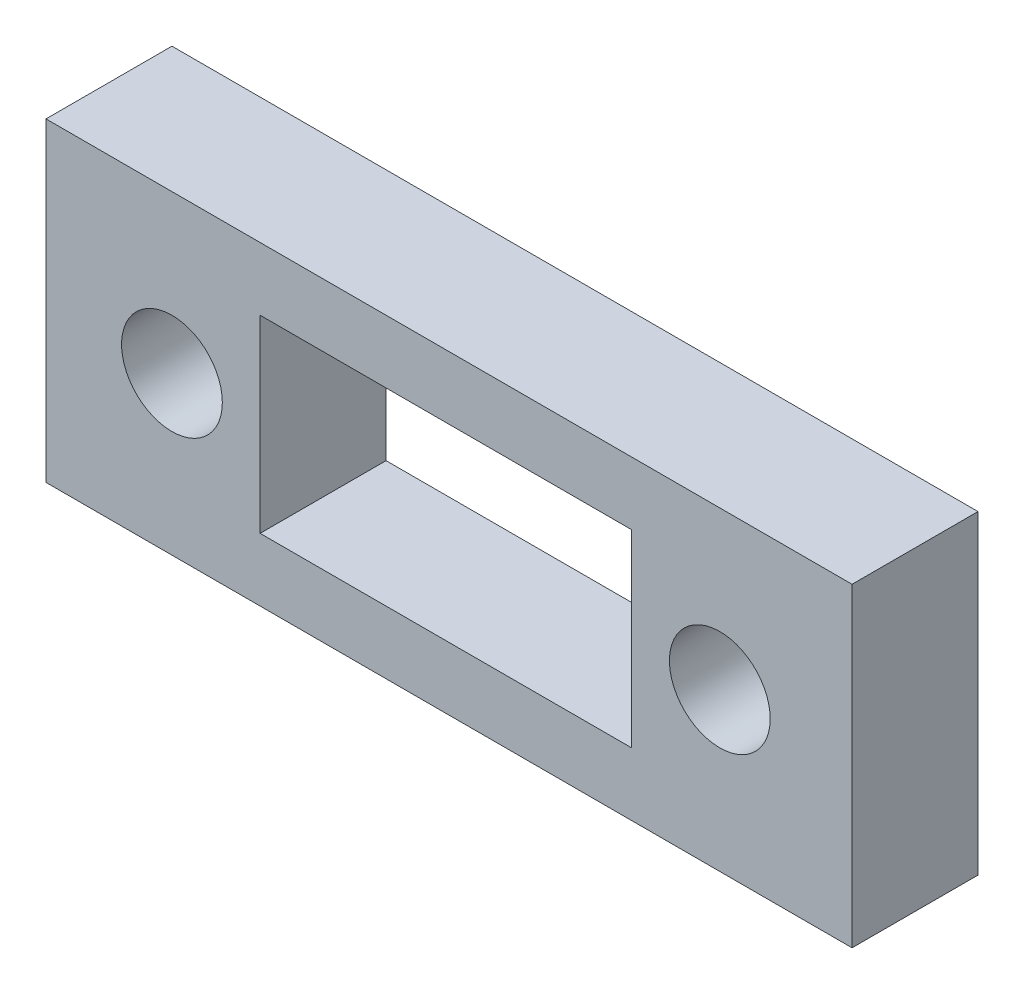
ISO-10303-21;
HEADER;
FILE_DESCRIPTION(('STEP AP214'),'2;1');
FILE_NAME('part.step','',(''),(''),'','','');
FILE_SCHEMA(('AUTOMOTIVE_DESIGN { 1 0 10303 214 1 1 1 1 }'));
ENDSEC;
DATA;
#1=APPLICATION_CONTEXT('core data for automotive mechanical design processes');
#2=APPLICATION_PROTOCOL_DEFINITION('international standard','automotive_design',2000,#1);
#3=PRODUCT_CONTEXT('',#1,'mechanical');
#4=PRODUCT('Part','Part','',(#3));
#5=PRODUCT_RELATED_PRODUCT_CATEGORY('part','',(#4));
#6=PRODUCT_DEFINITION_FORMATION('','',#4);
#7=PRODUCT_DEFINITION_CONTEXT('part definition',#1,'design');
#8=PRODUCT_DEFINITION('design','',#6,#7);
#9=PRODUCT_DEFINITION_SHAPE('','',#8);
#10=(LENGTH_UNIT() NAMED_UNIT(*) SI_UNIT(.MILLI.,.METRE.));
#11=(NAMED_UNIT(*) PLANE_ANGLE_UNIT() SI_UNIT($,.RADIAN.));
#12=(NAMED_UNIT(*) SI_UNIT($,.STERADIAN.) SOLID_ANGLE_UNIT());
#13=UNCERTAINTY_MEASURE_WITH_UNIT(LENGTH_MEASURE(1.E-05),#10,'distance_accuracy_value','');
#14=(GEOMETRIC_REPRESENTATION_CONTEXT(3) GLOBAL_UNCERTAINTY_ASSIGNED_CONTEXT((#13)) GLOBAL_UNIT_ASSIGNED_CONTEXT((#10,
#11,#12)) REPRESENTATION_CONTEXT('',''));
#15=CARTESIAN_POINT('',(0.,0.,0.));
#16=DIRECTION('',(0.,0.,1.));
#17=DIRECTION('',(1.,0.,0.));
#18=AXIS2_PLACEMENT_3D('',#15,#16,#17);
#19=CARTESIAN_POINT('',(-7.04952538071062,9.47419627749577,10.));
#20=DIRECTION('',(1.,0.,0.));
#21=DIRECTION('',(0.,0.,-1.));
#22=AXIS2_PLACEMENT_3D('',#19,#20,#21);
#23=PLANE('',#22);
#24=DIRECTION('',(0.,-1.,0.));
#25=VECTOR('',#24,1.);
#26=CARTESIAN_POINT('',(-7.04952538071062,9.47419627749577,0.));
#27=LINE('',#26,#25);
#28=CARTESIAN_POINT('',(-7.04952538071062,9.47419627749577,0.));
#29=VERTEX_POINT('',#28);
#30=CARTESIAN_POINT('',(-7.04952538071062,-15.5258037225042,0.));
#31=VERTEX_POINT('',#30);
#32=EDGE_CURVE('E143',#29,#31,#27,.T.);
#33=ORIENTED_EDGE('',*,*,#32,.T.);
#34=DIRECTION('',(0.,0.,-1.));
#35=VECTOR('',#34,1.);
#36=CARTESIAN_POINT('',(-7.04952538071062,-15.5258037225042,10.));
#37=LINE('',#36,#35);
#38=CARTESIAN_POINT('',(-7.04952538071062,-15.5258037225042,10.));
#39=VERTEX_POINT('',#38);
#40=EDGE_CURVE('E11',#39,#31,#37,.T.);
#41=ORIENTED_EDGE('',*,*,#40,.F.);
#42=DIRECTION('',(0.,-1.,0.));
#43=VECTOR('',#42,1.);
#44=CARTESIAN_POINT('',(-7.04952538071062,9.47419627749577,10.));
#45=LINE('',#44,#43);
#46=CARTESIAN_POINT('',(-7.04952538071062,9.47419627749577,10.));
#47=VERTEX_POINT('',#46);
#48=EDGE_CURVE('E146',#47,#39,#45,.T.);
#49=ORIENTED_EDGE('',*,*,#48,.F.);
#50=DIRECTION('',(0.,0.,-1.));
#51=VECTOR('',#50,1.);
#52=CARTESIAN_POINT('',(-7.04952538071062,9.47419627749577,10.));
#53=LINE('',#52,#51);
#54=EDGE_CURVE('E156',#47,#29,#53,.T.);
#55=ORIENTED_EDGE('',*,*,#54,.T.);
#56=EDGE_LOOP('',(#33,#41,#49,#55));
#57=FACE_BOUND('',#56,.T.);
#58=ADVANCED_FACE('F33',(#57),#23,.F.);
#59=CARTESIAN_POINT('',(-7.04952538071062,-15.5258037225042,10.));
#60=DIRECTION('',(0.,1.,0.));
#61=DIRECTION('',(0.,0.,1.));
#62=AXIS2_PLACEMENT_3D('',#59,#60,#61);
#63=PLANE('',#62);
#64=DIRECTION('',(1.,0.,0.));
#65=VECTOR('',#64,1.);
#66=CARTESIAN_POINT('',(-7.04952538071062,-15.5258037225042,0.));
#67=LINE('',#66,#65);
#68=CARTESIAN_POINT('',(56.9504746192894,-15.5258037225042,0.));
#69=VERTEX_POINT('',#68);
#70=EDGE_CURVE('E159',#31,#69,#67,.T.);
#71=ORIENTED_EDGE('',*,*,#70,.T.);
#72=DIRECTION('',(0.,0.,-1.));
#73=VECTOR('',#72,1.);
#74=CARTESIAN_POINT('',(56.9504746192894,-15.5258037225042,10.));
#75=LINE('',#74,#73);
#76=CARTESIAN_POINT('',(56.9504746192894,-15.5258037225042,10.));
#77=VERTEX_POINT('',#76);
#78=EDGE_CURVE('E40',#77,#69,#75,.T.);
#79=ORIENTED_EDGE('',*,*,#78,.F.);
#80=DIRECTION('',(1.,0.,0.));
#81=VECTOR('',#80,1.);
#82=CARTESIAN_POINT('',(-7.04952538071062,-15.5258037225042,10.));
#83=LINE('',#82,#81);
#84=EDGE_CURVE('E149',#39,#77,#83,.T.);
#85=ORIENTED_EDGE('',*,*,#84,.F.);
#86=ORIENTED_EDGE('',*,*,#40,.T.);
#87=EDGE_LOOP('',(#71,#79,#85,#86));
#88=FACE_BOUND('',#87,.T.);
#89=ADVANCED_FACE('F188',(#88),#63,.F.);
#90=CARTESIAN_POINT('',(56.9504746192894,9.47419627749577,10.));
#91=DIRECTION('',(-1.,0.,0.));
#92=DIRECTION('',(0.,-1.,0.));
#93=AXIS2_PLACEMENT_3D('',#90,#91,#92);
#94=PLANE('',#93);
#95=DIRECTION('',(0.,1.,0.));
#96=VECTOR('',#95,1.);
#97=CARTESIAN_POINT('',(56.9504746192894,9.47419627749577,0.));
#98=LINE('',#97,#96);
#99=CARTESIAN_POINT('',(56.9504746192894,9.47419627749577,0.));
#100=VERTEX_POINT('',#99);
#101=EDGE_CURVE('E161',#69,#100,#98,.T.);
#102=ORIENTED_EDGE('',*,*,#101,.T.);
#103=DIRECTION('',(0.,0.,-1.));
#104=VECTOR('',#103,1.);
#105=CARTESIAN_POINT('',(56.9504746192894,9.47419627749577,10.));
#106=LINE('',#105,#104);
#107=CARTESIAN_POINT('',(56.9504746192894,9.47419627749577,10.));
#108=VERTEX_POINT('',#107);
#109=EDGE_CURVE('E166',#108,#100,#106,.T.);
#110=ORIENTED_EDGE('',*,*,#109,.F.);
#111=DIRECTION('',(0.,1.,0.));
#112=VECTOR('',#111,1.);
#113=CARTESIAN_POINT('',(56.9504746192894,9.47419627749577,10.));
#114=LINE('',#113,#112);
#115=EDGE_CURVE('E152',#77,#108,#114,.T.);
#116=ORIENTED_EDGE('',*,*,#115,.F.);
#117=ORIENTED_EDGE('',*,*,#78,.T.);
#118=EDGE_LOOP('',(#102,#110,#116,#117));
#119=FACE_BOUND('',#118,.T.);
#120=ADVANCED_FACE('F173',(#119),#94,.F.);
#121=CARTESIAN_POINT('',(-7.04952538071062,9.47419627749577,10.));
#122=DIRECTION('',(0.,-1.,0.));
#123=DIRECTION('',(0.,0.,-1.));
#124=AXIS2_PLACEMENT_3D('',#121,#122,#123);
#125=PLANE('',#124);
#126=DIRECTION('',(-1.,0.,0.));
#127=VECTOR('',#126,1.);
#128=CARTESIAN_POINT('',(-7.04952538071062,9.47419627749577,0.));
#129=LINE('',#128,#127);
#130=EDGE_CURVE('E150',#100,#29,#129,.T.);
#131=ORIENTED_EDGE('',*,*,#130,.T.);
#132=ORIENTED_EDGE('',*,*,#54,.F.);
#133=DIRECTION('',(-1.,0.,0.));
#134=VECTOR('',#133,1.);
#135=CARTESIAN_POINT('',(-7.04952538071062,9.47419627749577,10.));
#136=LINE('',#135,#134);
#137=EDGE_CURVE('E154',#108,#47,#136,.T.);
#138=ORIENTED_EDGE('',*,*,#137,.F.);
#139=ORIENTED_EDGE('',*,*,#109,.T.);
#140=EDGE_LOOP('',(#131,#132,#138,#139));
#141=FACE_BOUND('',#140,.T.);
#142=ADVANCED_FACE('F181',(#141),#125,.F.);
#143=CARTESIAN_POINT('',(0.,0.,10.));
#144=DIRECTION('',(0.,0.,1.));
#145=DIRECTION('',(1.,0.,0.));
#146=AXIS2_PLACEMENT_3D('',#143,#144,#145);
#147=PLANE('',#146);
#148=DIRECTION('',(0.,-1.,0.));
#149=VECTOR('',#148,1.);
#150=CARTESIAN_POINT('',(9.95047461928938,-10.5258037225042,10.));
#151=LINE('',#150,#149);
#152=CARTESIAN_POINT('',(9.95047461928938,4.47419627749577,10.));
#153=VERTEX_POINT('',#152);
#154=CARTESIAN_POINT('',(9.95047461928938,-10.5258037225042,10.));
#155=VERTEX_POINT('',#154);
#156=EDGE_CURVE('E47',#153,#155,#151,.T.);
#157=ORIENTED_EDGE('',*,*,#156,.F.);
#158=DIRECTION('',(-1.,0.,0.));
#159=VECTOR('',#158,1.);
#160=CARTESIAN_POINT('',(9.95047461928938,4.47419627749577,10.));
#161=LINE('',#160,#159);
#162=CARTESIAN_POINT('',(39.4504746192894,4.47419627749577,10.));
#163=VERTEX_POINT('',#162);
#164=EDGE_CURVE('E115',#163,#153,#161,.T.);
#165=ORIENTED_EDGE('',*,*,#164,.F.);
#166=DIRECTION('',(0.,1.,0.));
#167=VECTOR('',#166,1.);
#168=CARTESIAN_POINT('',(39.4504746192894,-10.5258037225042,10.));
#169=LINE('',#168,#167);
#170=CARTESIAN_POINT('',(39.4504746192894,-10.5258037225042,10.));
#171=VERTEX_POINT('',#170);
#172=EDGE_CURVE('E118',#171,#163,#169,.T.);
#173=ORIENTED_EDGE('',*,*,#172,.F.);
#174=DIRECTION('',(1.,0.,0.));
#175=VECTOR('',#174,1.);
#176=CARTESIAN_POINT('',(9.95047461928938,-10.5258037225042,10.));
#177=LINE('',#176,#175);
#178=EDGE_CURVE('E124',#155,#171,#177,.T.);
#179=ORIENTED_EDGE('',*,*,#178,.F.);
#180=EDGE_LOOP('',(#157,#165,#173,#179));
#181=FACE_BOUND('',#180,.T.);
#182=CARTESIAN_POINT('',(46.4504746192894,-3.02580372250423,10.));
#183=DIRECTION('',(0.,0.,1.));
#184=DIRECTION('',(1.,0.,0.));
#185=AXIS2_PLACEMENT_3D('',#182,#183,#184);
#186=CIRCLE('',#185,4.00000000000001);
#187=CARTESIAN_POINT('',(50.4504746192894,-3.02580372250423,10.));
#188=VERTEX_POINT('',#187);
#189=EDGE_CURVE('E130',#188,#188,#186,.T.);
#190=ORIENTED_EDGE('',*,*,#189,.F.);
#191=EDGE_LOOP('',(#190));
#192=FACE_BOUND('',#191,.T.);
#193=CARTESIAN_POINT('',(2.95047461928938,-3.02580372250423,10.));
#194=DIRECTION('',(0.,0.,1.));
#195=DIRECTION('',(1.,0.,0.));
#196=AXIS2_PLACEMENT_3D('',#193,#194,#195);
#197=CIRCLE('',#196,4.);
#198=CARTESIAN_POINT('',(6.95047461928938,-3.02580372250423,10.));
#199=VERTEX_POINT('',#198);
#200=EDGE_CURVE('E137',#199,#199,#197,.T.);
#201=ORIENTED_EDGE('',*,*,#200,.F.);
#202=EDGE_LOOP('',(#201));
#203=FACE_BOUND('',#202,.T.);
#204=ORIENTED_EDGE('',*,*,#48,.T.);
#205=ORIENTED_EDGE('',*,*,#84,.T.);
#206=ORIENTED_EDGE('',*,*,#115,.T.);
#207=ORIENTED_EDGE('',*,*,#137,.T.);
#208=EDGE_LOOP('',(#204,#205,#206,#207));
#209=FACE_BOUND('',#208,.T.);
#210=ADVANCED_FACE('F187',(#181,#192,#203,#209),#147,.T.);
#211=CARTESIAN_POINT('',(0.,0.,0.));
#212=DIRECTION('',(0.,0.,1.));
#213=DIRECTION('',(1.,0.,0.));
#214=AXIS2_PLACEMENT_3D('',#211,#212,#213);
#215=PLANE('',#214);
#216=DIRECTION('',(-1.,0.,0.));
#217=VECTOR('',#216,1.);
#218=CARTESIAN_POINT('',(9.95047461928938,4.47419627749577,0.));
#219=LINE('',#218,#217);
#220=CARTESIAN_POINT('',(39.4504746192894,4.47419627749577,0.));
#221=VERTEX_POINT('',#220);
#222=CARTESIAN_POINT('',(9.95047461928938,4.47419627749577,0.));
#223=VERTEX_POINT('',#222);
#224=EDGE_CURVE('E105',#221,#223,#219,.T.);
#225=ORIENTED_EDGE('',*,*,#224,.T.);
#226=DIRECTION('',(0.,-1.,0.));
#227=VECTOR('',#226,1.);
#228=CARTESIAN_POINT('',(9.95047461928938,-10.5258037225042,0.));
#229=LINE('',#228,#227);
#230=CARTESIAN_POINT('',(9.95047461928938,-10.5258037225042,0.));
#231=VERTEX_POINT('',#230);
#232=EDGE_CURVE('E99',#223,#231,#229,.T.);
#233=ORIENTED_EDGE('',*,*,#232,.T.);
#234=DIRECTION('',(1.,0.,0.));
#235=VECTOR('',#234,1.);
#236=CARTESIAN_POINT('',(9.95047461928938,-10.5258037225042,0.));
#237=LINE('',#236,#235);
#238=CARTESIAN_POINT('',(39.4504746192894,-10.5258037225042,0.));
#239=VERTEX_POINT('',#238);
#240=EDGE_CURVE('E108',#231,#239,#237,.T.);
#241=ORIENTED_EDGE('',*,*,#240,.T.);
#242=DIRECTION('',(0.,1.,0.));
#243=VECTOR('',#242,1.);
#244=CARTESIAN_POINT('',(39.4504746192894,-10.5258037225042,0.));
#245=LINE('',#244,#243);
#246=EDGE_CURVE('E55',#239,#221,#245,.T.);
#247=ORIENTED_EDGE('',*,*,#246,.T.);
#248=EDGE_LOOP('',(#225,#233,#241,#247));
#249=FACE_BOUND('',#248,.T.);
#250=CARTESIAN_POINT('',(46.4504746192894,-3.02580372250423,0.));
#251=DIRECTION('',(0.,0.,1.));
#252=DIRECTION('',(1.,0.,0.));
#253=AXIS2_PLACEMENT_3D('',#250,#251,#252);
#254=CIRCLE('',#253,4.00000000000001);
#255=CARTESIAN_POINT('',(50.4504746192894,-3.02580372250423,0.));
#256=VERTEX_POINT('',#255);
#257=EDGE_CURVE('E134',#256,#256,#254,.T.);
#258=ORIENTED_EDGE('',*,*,#257,.T.);
#259=EDGE_LOOP('',(#258));
#260=FACE_BOUND('',#259,.T.);
#261=CARTESIAN_POINT('',(2.95047461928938,-3.02580372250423,0.));
#262=DIRECTION('',(0.,0.,1.));
#263=DIRECTION('',(1.,0.,0.));
#264=AXIS2_PLACEMENT_3D('',#261,#262,#263);
#265=CIRCLE('',#264,4.);
#266=CARTESIAN_POINT('',(6.95047461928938,-3.02580372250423,0.));
#267=VERTEX_POINT('',#266);
#268=EDGE_CURVE('E140',#267,#267,#265,.T.);
#269=ORIENTED_EDGE('',*,*,#268,.T.);
#270=EDGE_LOOP('',(#269));
#271=FACE_BOUND('',#270,.T.);
#272=ORIENTED_EDGE('',*,*,#32,.F.);
#273=ORIENTED_EDGE('',*,*,#130,.F.);
#274=ORIENTED_EDGE('',*,*,#101,.F.);
#275=ORIENTED_EDGE('',*,*,#70,.F.);
#276=EDGE_LOOP('',(#272,#273,#274,#275));
#277=FACE_BOUND('',#276,.T.);
#278=ADVANCED_FACE('F112',(#249,#260,#271,#277),#215,.F.);
#279=CARTESIAN_POINT('',(2.95047461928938,-3.02580372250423,0.));
#280=DIRECTION('',(0.,0.,1.));
#281=DIRECTION('',(1.,0.,0.));
#282=AXIS2_PLACEMENT_3D('',#279,#280,#281);
#283=CYLINDRICAL_SURFACE('',#282,4.);
#284=ORIENTED_EDGE('',*,*,#268,.F.);
#285=EDGE_LOOP('',(#284));
#286=FACE_BOUND('',#285,.T.);
#287=ORIENTED_EDGE('',*,*,#200,.T.);
#288=EDGE_LOOP('',(#287));
#289=FACE_BOUND('',#288,.T.);
#290=ADVANCED_FACE('F200',(#286,#289),#283,.F.);
#291=CARTESIAN_POINT('',(46.4504746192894,-3.02580372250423,0.));
#292=DIRECTION('',(0.,0.,1.));
#293=DIRECTION('',(1.,0.,0.));
#294=AXIS2_PLACEMENT_3D('',#291,#292,#293);
#295=CYLINDRICAL_SURFACE('',#294,4.00000000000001);
#296=ORIENTED_EDGE('',*,*,#257,.F.);
#297=EDGE_LOOP('',(#296));
#298=FACE_BOUND('',#297,.T.);
#299=ORIENTED_EDGE('',*,*,#189,.T.);
#300=EDGE_LOOP('',(#299));
#301=FACE_BOUND('',#300,.T.);
#302=ADVANCED_FACE('F206',(#298,#301),#295,.F.);
#303=CARTESIAN_POINT('',(9.95047461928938,-10.5258037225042,0.));
#304=DIRECTION('',(-1.,0.,0.));
#305=DIRECTION('',(0.,0.,1.));
#306=AXIS2_PLACEMENT_3D('',#303,#304,#305);
#307=PLANE('',#306);
#308=ORIENTED_EDGE('',*,*,#156,.T.);
#309=DIRECTION('',(0.,0.,1.));
#310=VECTOR('',#309,1.);
#311=CARTESIAN_POINT('',(9.95047461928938,-10.5258037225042,0.));
#312=LINE('',#311,#310);
#313=EDGE_CURVE('E95',#231,#155,#312,.T.);
#314=ORIENTED_EDGE('',*,*,#313,.F.);
#315=ORIENTED_EDGE('',*,*,#232,.F.);
#316=DIRECTION('',(0.,0.,1.));
#317=VECTOR('',#316,1.);
#318=CARTESIAN_POINT('',(9.95047461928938,4.47419627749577,0.));
#319=LINE('',#318,#317);
#320=EDGE_CURVE('E128',#223,#153,#319,.T.);
#321=ORIENTED_EDGE('',*,*,#320,.T.);
#322=EDGE_LOOP('',(#308,#314,#315,#321));
#323=FACE_BOUND('',#322,.T.);
#324=ADVANCED_FACE('F97',(#323),#307,.F.);
#325=CARTESIAN_POINT('',(9.95047461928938,4.47419627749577,0.));
#326=DIRECTION('',(0.,1.,0.));
#327=DIRECTION('',(0.,0.,1.));
#328=AXIS2_PLACEMENT_3D('',#325,#326,#327);
#329=PLANE('',#328);
#330=ORIENTED_EDGE('',*,*,#164,.T.);
#331=ORIENTED_EDGE('',*,*,#320,.F.);
#332=ORIENTED_EDGE('',*,*,#224,.F.);
#333=DIRECTION('',(0.,0.,1.));
#334=VECTOR('',#333,1.);
#335=CARTESIAN_POINT('',(39.4504746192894,4.47419627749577,0.));
#336=LINE('',#335,#334);
#337=EDGE_CURVE('E131',#221,#163,#336,.T.);
#338=ORIENTED_EDGE('',*,*,#337,.T.);
#339=EDGE_LOOP('',(#330,#331,#332,#338));
#340=FACE_BOUND('',#339,.T.);
#341=ADVANCED_FACE('F213',(#340),#329,.F.);
#342=CARTESIAN_POINT('',(39.4504746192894,-10.5258037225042,0.));
#343=DIRECTION('',(1.,0.,0.));
#344=DIRECTION('',(0.,0.,-1.));
#345=AXIS2_PLACEMENT_3D('',#342,#343,#344);
#346=PLANE('',#345);
#347=ORIENTED_EDGE('',*,*,#172,.T.);
#348=ORIENTED_EDGE('',*,*,#337,.F.);
#349=ORIENTED_EDGE('',*,*,#246,.F.);
#350=DIRECTION('',(0.,0.,1.));
#351=VECTOR('',#350,1.);
#352=CARTESIAN_POINT('',(39.4504746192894,-10.5258037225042,0.));
#353=LINE('',#352,#351);
#354=EDGE_CURVE('E104',#239,#171,#353,.T.);
#355=ORIENTED_EDGE('',*,*,#354,.T.);
#356=EDGE_LOOP('',(#347,#348,#349,#355));
#357=FACE_BOUND('',#356,.T.);
#358=ADVANCED_FACE('F216',(#357),#346,.F.);
#359=CARTESIAN_POINT('',(9.95047461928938,-10.5258037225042,0.));
#360=DIRECTION('',(0.,-1.,0.));
#361=DIRECTION('',(0.,0.,-1.));
#362=AXIS2_PLACEMENT_3D('',#359,#360,#361);
#363=PLANE('',#362);
#364=ORIENTED_EDGE('',*,*,#178,.T.);
#365=ORIENTED_EDGE('',*,*,#354,.F.);
#366=ORIENTED_EDGE('',*,*,#240,.F.);
#367=ORIENTED_EDGE('',*,*,#313,.T.);
#368=EDGE_LOOP('',(#364,#365,#366,#367));
#369=FACE_BOUND('',#368,.T.);
#370=ADVANCED_FACE('F109',(#369),#363,.F.);
#371=CLOSED_SHELL('',(#58,#89,#120,#142,#210,#278,#290,#302,#324,#341,#358,#370));
#372=MANIFOLD_SOLID_BREP('B2',#371);
#373=ADVANCED_BREP_SHAPE_REPRESENTATION('',(#18,#372),#14);
#374=SHAPE_DEFINITION_REPRESENTATION(#9,#373);
ENDSEC;
END-ISO-10303-21;
